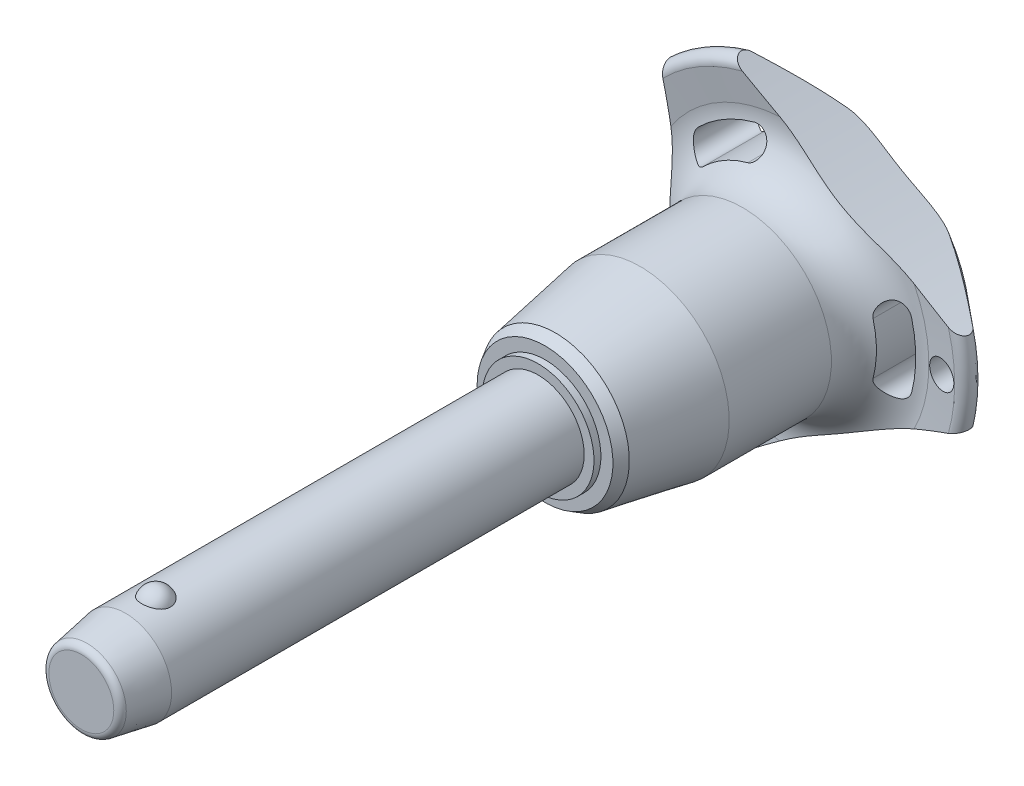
from build123d import *

# Parameters (mm, degrees)
SKETCH1_R           = 5
BOSS_EXTRUDE1_DEPTH = 40
SKETCH2_R           = 4.25
BOSS_EXTRUDE2_DEPTH = 33.3
BOSS_EXTRUDE3_START = 9.6
SKETCH1_2_R         = 5
BOSS_EXTRUDE3_DEPTH = 9.6
CHAMFER1_SIZE       = 4.8
CHAMFER1_SIZE2      = 0.846369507
FILLET1_R           = 0.75
SKETCH6_R           = 102.8
CUT_EXTRUDE1_DEPTH  = 79.369242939
CIRPATTERN1_COUNT   = 3
SKETCH7_R           = 1.5
CUT_EXTRUDE2_DEPTH  = 79.162591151


with BuildPart() as part:
    # Sketch1 → Boss-Extrude1 (new body)
    with BuildSketch(Plane.XY):
        Circle(SKETCH1_R)
    extrude(amount=-BOSS_EXTRUDE1_DEPTH)

    # Sketch2 → Boss-Extrude2 (add)
    with BuildSketch(Plane(origin=(0, 0, -40), x_dir=(-1, 0, 0), z_dir=(0, 0, -1))):
        Circle(SKETCH2_R)
    extrude(amount=BOSS_EXTRUDE2_DEPTH)

    # Sketch3 → Revolve1 (revolve)
    with BuildSketch(Plane(origin=(0, 0, 0), x_dir=(0, 0, -1), z_dir=(1, 0, 0))):
        with BuildLine():
            Line((-1.516575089, 6), (-1.516575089, 2.7))
            ThreePointArc((-1.516575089, 2.7), (0.133424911, 4.35), (-1.516575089, 6))
        make_face()
        with BuildLine():
            Line((-1.516575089, -2.7), (-1.516575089, -6))
            ThreePointArc((-1.516575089, -6), (0.133424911, -4.35), (-1.516575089, -2.7))
        make_face()
    revolve(axis=Axis((0, -2.7, 1.516575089), (0, 1, 0)))

    # Sketch1_2 → Boss-Extrude3 (add)
    with BuildSketch(Plane.XY.offset(BOSS_EXTRUDE3_START)):
        Circle(SKETCH1_2_R)
    extrude(amount=-BOSS_EXTRUDE3_DEPTH)

    # Chamfer1
    chamfer1_edges = [part.edges().sort_by_distance(p)[0] for p in [
        (-5, 0, 9.6),
    ]]
    chamfer1_side = [part.faces().sort_by_distance(p)[0] for p in [
        (-5, 0, -15.2),
    ]]
    chamfer(chamfer1_edges, length=CHAMFER1_SIZE, length2=CHAMFER1_SIZE2, reference=chamfer1_side[0])

    # Fillet1
    fillet1_edges = [part.edges().sort_by_distance(p)[0] for p in [
        (-4.153630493, 0, 9.6),
        (4.25, 0, -73.3),
    ]]
    fillet(fillet1_edges, radius=FILLET1_R)

    # Sketch4 → Revolve2 (revolve)
    with BuildSketch(Plane(origin=(0, 0, 0), x_dir=(0, 0, -1), z_dir=(1, 0, 0)), mode=Mode.PRIVATE) as revolve2_sk:
        Polygon((40, 0), (40, 6.067402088), (40.75, 6.067402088), (40.75, 7.371950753), (41.879772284, 8.024225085), (51.1, 9.65), (62.2, 9.65), (62.2, 0), align=None)
    revolve(revolve2_sk.sketch.rotate(Axis((0, 0, -62.2), (0, 0, 1)), 90), axis=Axis((0, 0, -62.2), (0, 0, 1)))

    # Sketch5 → Revolve3 (revolve)
    with BuildSketch(Plane(origin=(0, 0, 0), x_dir=(0, 0, -1), z_dir=(1, 0, 0)), mode=Mode.PRIVATE) as revolve3_sk:
        with BuildLine():
            Line((67.16082631, 15.274661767), (66.757834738, 18.475067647))
            ThreePointArc((66.757834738, 18.475067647), (67.349836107, 19.516443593), (68.516044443, 19.24278761))
            Line((68.516044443, 19.24278761), (72.835691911, 14.094832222))
            ThreePointArc((72.835691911, 14.094832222), (73.3, 12.689260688), (72.67067517, 11.349423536))
            ThreePointArc((72.67067517, 11.349423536), (69.033110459, 6.185112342), (67.75, 0))
            Line((67.75, 0), (62.2, 0))
            Line((62.2, 0), (62.2, 9.65))
            ThreePointArc((62.2, 9.65), (65.949887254, 11.342683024), (67.16082631, 15.274661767))
        make_face()
    revolve(revolve3_sk.sketch.rotate(Axis((0, 0, -67.75), (0, 0, 1)), 90), axis=Axis((0, 0, -67.75), (0, 0, 1)))

    # Sketch6 → Cut-Extrude1 (cut, through all)
    with BuildSketch(Plane.XY):
        with Locations((-115.2, 0)):
            Circle(SKETCH6_R)
        with BuildLine():
            ThreePointArc((13.411913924, -3.529271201), (13.868496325, 0), (13.411913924, 3.529271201))
            ThreePointArc((13.411913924, 3.529271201), (11.694200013, 4.531299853), (10.692171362, 2.813585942))
            ThreePointArc((10.692171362, 2.813585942), (11.056165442, 0), (10.692171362, -2.813585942))
            ThreePointArc((10.692171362, -2.813585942), (11.694200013, -4.531299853), (13.411913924, -3.529271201))
        make_face()
    cut_extrude1 = extrude(amount=-CUT_EXTRUDE1_DEPTH, mode=Mode.SUBTRACT)

    # CirPattern1: Cut-Extrude1 ×3 about axis
    cirpattern1_axis = Axis((0, 0, 0), (0, 0, 1))
    for i in range(1, CIRPATTERN1_COUNT):
        add(cut_extrude1.rotate(cirpattern1_axis, i * 360 / CIRPATTERN1_COUNT), mode=Mode.SUBTRACT)

    # Sketch7 → Cut-Extrude2 (cut, through all)
    with BuildSketch(Plane.XY):
        with Locations(Location((16.868496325, 0, 0), (0, 0, 225.467095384))):
            Circle(SKETCH7_R)
    extrude(amount=-CUT_EXTRUDE2_DEPTH, mode=Mode.SUBTRACT)


solid = part.part
